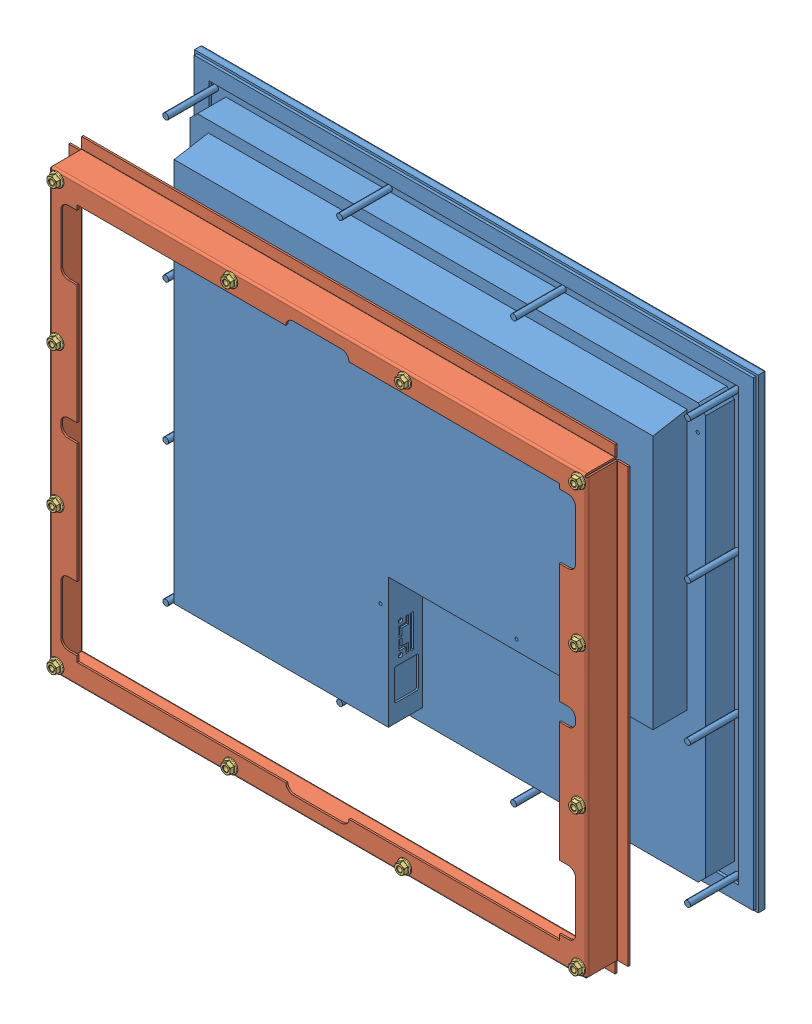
SolidWorks assembly 19 inch Panel Mount Monitor, HIS-ML19-xxxH.SLDASM, configuration Default (file format 10000). Lengths in mm.
Overall size (482.6 398.78 147.61).
14 component instances, 3 part files, 26 mates.
Components (placement in the parent):
- Monitor, 19H-2: Monitor, 19H.sldprt [Default] at origin size (482.6 398.78 60.88)
- Collar, 10043-1: Collar, 10043.sldprt [Default] at (0.046 -0.0187 133.9744) size (478.8 392.57 27.43)
- M5 Nut, 30008-1: M5 Nut, 30008.sldprt [M5 Nut - 30008] at (-223.2751 180.1876 140.4934) size (11.8 11.8 5)
- M5 Nut, 30008-2: M5 Nut, 30008.sldprt [M5 Nut - 30008] at (-74.3803 180.1876 140.4934) size (11.8 11.8 5)
- M5 Nut, 30008-3: M5 Nut, 30008.sldprt [M5 Nut - 30008] at (74.5145 180.1876 140.4934) size (11.8 11.8 5)
- M5 Nut, 30008-4: M5 Nut, 30008.sldprt [M5 Nut - 30008] at (223.3676 180.1876 140.4934) x (0 -1 0) z (0 0 1) size (11.8 11.8 5)
- M5 Nut, 30008-5: M5 Nut, 30008.sldprt [M5 Nut - 30008] at (223.3786 60.05 140.4934) x (0 1 0) z (0 0 1) size (11.8 11.8 5)
- M5 Nut, 30008-6: M5 Nut, 30008.sldprt [M5 Nut - 30008] at (223.3895 -60.0875 140.4934) x (0 -1 0) z (0 0 1) size (11.8 11.8 5)
- M5 Nut, 30008-7: M5 Nut, 30008.sldprt [M5 Nut - 30008] at (223.4005 -180.2251 140.4934) size (11.8 11.8 5)
- M5 Nut, 30008-8: M5 Nut, 30008.sldprt [M5 Nut - 30008] at (74.5145 -180.2251 140.4934) size (11.8 11.8 5)
- M5 Nut, 30008-9: M5 Nut, 30008.sldprt [M5 Nut - 30008] at (-74.3803 -180.2251 140.4934) size (11.8 11.8 5)
- M5 Nut, 30008-10: M5 Nut, 30008.sldprt [M5 Nut - 30008] at (-223.2751 -180.2251 140.4934) size (11.8 11.8 5)
- M5 Nut, 30008-11: M5 Nut, 30008.sldprt [M5 Nut - 30008] at (-223.2642 -60.0875 140.4934) size (11.8 11.8 5)
- M5 Nut, 30008-12: M5 Nut, 30008.sldprt [M5 Nut - 30008] at (-223.2532 60.05 140.4934) size (11.8 11.8 5)
Mates (geometry in assembly coordinates):
- Concentric1: concentric anti-aligned: cylinder of Monitor, 19H-2 through (223.3676 180.1876 42.7) axis (0 0 -1) radius 2.5; cylinder of Collar, 10043-1 through (223.3676 180.1876 135.4934) axis (0 0 1) radius 3.175
- Parallel1: parallel anti-aligned: line of Monitor, 19H-2 through (482.6 241.3 199.39) axis (0 -1 0); line of Collar, 10043-1 through (-228.3025 196.2658 109.5803) axis (1 0 0)
- Concentric41: concentric: cylinder of Collar, 10043-1 through (-223.2751 180.1876 135.4934) axis (0 0 1) radius 3.175; cylinder of M5 Nut, 30008-1 through (-229.5644 169.4316 104.3135) axis (0 0 1) radius 2.5
- Coincident31: coincident: plane of Collar, 10043-1 through (0.046 -0.0187 135.4934) normal (0 0 1); plane of M5 Nut, 30008-1 through (-229.5644 174.0504 124.351) normal (0 0 -1)
- Concentric51: concentric: cylinder of Collar, 10043-1 through (-74.3803 180.1876 135.4934) axis (0 0 1) radius 3.175; cylinder of M5 Nut, 30008-2 through (-131.1426 122.247 53.0687) axis (0 0 1) radius 2.5
- Coincident41: coincident: plane of Collar, 10043-1 through (0.046 -0.0187 135.4934) normal (0 0 1); plane of M5 Nut, 30008-2 through (-131.1426 126.8658 73.1062) normal (0 0 -1)
- Concentric61: concentric: cylinder of Collar, 10043-1 through (74.5145 180.1876 135.4934) axis (0 0 1) radius 3.175; cylinder of M5 Nut, 30008-3 through (-31.6214 69.5925 6.1934) axis (0 0 1) radius 2.5
- Coincident51: coincident: plane of Collar, 10043-1 through (0.046 -0.0187 135.4934) normal (0 0 1); plane of M5 Nut, 30008-3 through (-31.6214 74.2113 26.2309) normal (0 0 -1)
- Concentric71: concentric: cylinder of Collar, 10043-1 through (223.3676 180.1876 135.4934) axis (0 0 1) radius 3.175; cylinder of M5 Nut, 30008-4 through (65.9838 20.2888 -42.1161) axis (0 0 1) radius 2.5
- Coincident61: coincident: plane of Collar, 10043-1 through (0.046 -0.0187 135.4934) normal (0 0 1); plane of M5 Nut, 30008-4 through (70.6026 20.2888 -22.0786) normal (0 0 -1)
- Concentric81: concentric: cylinder of Collar, 10043-1 through (223.3786 60.05 135.4934) axis (0 0 1) radius 3.175; cylinder of M5 Nut, 30008-5 through (107.8026 -59.3783 -4.2808) axis (0 0 1) radius 2.5
- Coincident71: coincident: plane of Collar, 10043-1 through (0.046 -0.0187 135.4934) normal (0 0 1); plane of M5 Nut, 30008-5 through (103.1838 -59.3783 15.7567) normal (0 0 -1)
- Concentric91: concentric: cylinder of Collar, 10043-1 through (223.3895 -60.0875 135.4934) axis (0 0 1) radius 3.175; cylinder of M5 Nut, 30008-6 through (146.1039 -139.3684 37.3951) axis (0 0 1) radius 2.5
- Coincident81: coincident: plane of Collar, 10043-1 through (0.046 -0.0187 135.4934) normal (0 0 1); plane of M5 Nut, 30008-6 through (150.7227 -139.3684 57.4326) normal (0 0 -1)
- Concentric101: concentric: cylinder of Collar, 10043-1 through (223.4005 -180.2251 135.4934) axis (0 0 1) radius 3.175; cylinder of M5 Nut, 30008-7 through (185.3016 -215.4258 74.2424) axis (0 0 1) radius 2.5
- Coincident91: coincident: plane of Collar, 10043-1 through (0.046 -0.0187 135.4934) normal (0 0 1); plane of M5 Nut, 30008-7 through (185.3016 -210.807 94.2799) normal (0 0 -1)
- Concentric111: concentric: cylinder of Collar, 10043-1 through (74.5145 -180.2251 135.4934) axis (0 0 1) radius 3.175; cylinder of M5 Nut, 30008-8 through (89.1591 -169.2381 124.2047) axis (0 0 1) radius 2.5
- Coincident101: coincident: plane of Collar, 10043-1 through (0.046 -0.0187 135.4934) normal (0 0 1); plane of M5 Nut, 30008-8 through (89.1591 -164.6193 144.2422) normal (0 0 -1)
- Concentric121: concentric: cylinder of Collar, 10043-1 through (-74.3803 -180.2251 135.4934) axis (0 0 1) radius 3.175; cylinder of M5 Nut, 30008-9 through (-12.562 -115.9697 172.6661) axis (0 0 1) radius 2.5
- Coincident111: coincident: plane of Collar, 10043-1 through (0.046 -0.0187 135.4934) normal (0 0 1); plane of M5 Nut, 30008-9 through (-12.562 -111.3509 192.7036) normal (0 0 -1)
- Concentric131: concentric: cylinder of Collar, 10043-1 through (-223.2751 -180.2251 135.4934) axis (0 0 1) radius 3.175; cylinder of M5 Nut, 30008-10 through (-109.4453 -69.482 223.0692) axis (0 0 1) radius 2.5
- Coincident121: coincident: plane of Collar, 10043-1 through (0.046 -0.0187 135.4934) normal (0 0 1); plane of M5 Nut, 30008-10 through (-109.4453 -64.8632 243.1067) normal (0 0 -1)
- Concentric141: concentric: cylinder of Collar, 10043-1 through (-223.2642 -60.0875 135.4934) axis (0 0 1) radius 3.175; cylinder of M5 Nut, 30008-11 through (-149.6283 9.4768 184.3062) axis (0 0 1) radius 2.5
- Coincident131: coincident: plane of Collar, 10043-1 through (0.046 -0.0187 135.4934) normal (0 0 1); plane of M5 Nut, 30008-11 through (-149.6283 14.0956 204.3437) normal (0 0 -1)
- Concentric151: concentric: cylinder of Collar, 10043-1 through (-223.2532 60.05 135.4934) axis (0 0 1) radius 3.175; cylinder of M5 Nut, 30008-12 through (-189.5817 90.9518 142.7978) axis (0 0 1) radius 2.5
- Coincident141: coincident: plane of Collar, 10043-1 through (0.046 -0.0187 135.4934) normal (0 0 1); plane of M5 Nut, 30008-12 through (-189.5817 95.5706 162.8353) normal (0 0 -1)
